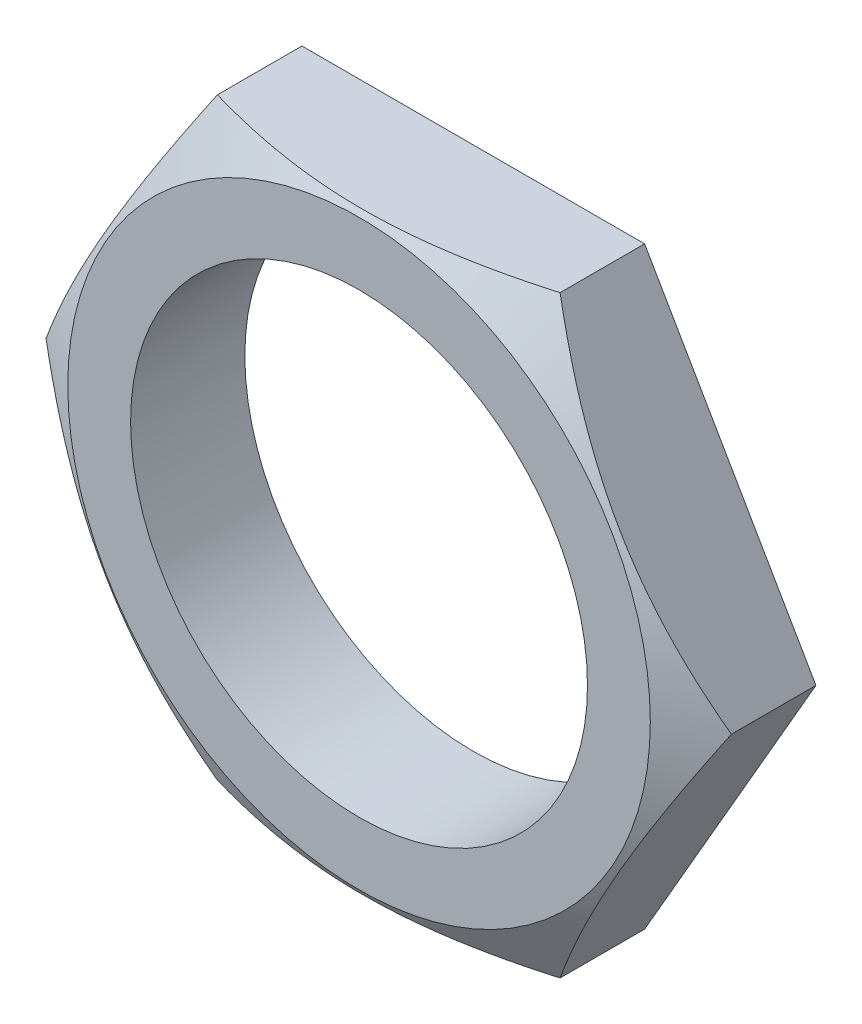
ISO-10303-21;
HEADER;
FILE_DESCRIPTION(('STEP AP214'),'2;1');
FILE_NAME('part.step','',(''),(''),'','','');
FILE_SCHEMA(('AUTOMOTIVE_DESIGN { 1 0 10303 214 1 1 1 1 }'));
ENDSEC;
DATA;
#1=APPLICATION_CONTEXT('core data for automotive mechanical design processes');
#2=APPLICATION_PROTOCOL_DEFINITION('international standard','automotive_design',2000,#1);
#3=PRODUCT_CONTEXT('',#1,'mechanical');
#4=PRODUCT('Part','Part','',(#3));
#5=PRODUCT_RELATED_PRODUCT_CATEGORY('part','',(#4));
#6=PRODUCT_DEFINITION_FORMATION('','',#4);
#7=PRODUCT_DEFINITION_CONTEXT('part definition',#1,'design');
#8=PRODUCT_DEFINITION('design','',#6,#7);
#9=PRODUCT_DEFINITION_SHAPE('','',#8);
#10=(LENGTH_UNIT() NAMED_UNIT(*) SI_UNIT(.MILLI.,.METRE.));
#11=(NAMED_UNIT(*) PLANE_ANGLE_UNIT() SI_UNIT($,.RADIAN.));
#12=(NAMED_UNIT(*) SI_UNIT($,.STERADIAN.) SOLID_ANGLE_UNIT());
#13=UNCERTAINTY_MEASURE_WITH_UNIT(LENGTH_MEASURE(1.E-05),#10,'distance_accuracy_value','');
#14=(GEOMETRIC_REPRESENTATION_CONTEXT(3) GLOBAL_UNCERTAINTY_ASSIGNED_CONTEXT((#13)) GLOBAL_UNIT_ASSIGNED_CONTEXT((#10,
#11,#12)) REPRESENTATION_CONTEXT('',''));
#15=CARTESIAN_POINT('',(0.,0.,0.));
#16=DIRECTION('',(0.,0.,1.));
#17=DIRECTION('',(1.,0.,0.));
#18=AXIS2_PLACEMENT_3D('',#15,#16,#17);
#19=CARTESIAN_POINT('',(0.,0.,2.));
#20=DIRECTION('',(0.,0.,1.));
#21=DIRECTION('',(1.,0.,0.));
#22=AXIS2_PLACEMENT_3D('',#19,#20,#21);
#23=PLANE('',#22);
#24=CARTESIAN_POINT('',(0.,0.,2.));
#25=DIRECTION('',(0.,0.,1.));
#26=DIRECTION('',(1.,0.,0.));
#27=AXIS2_PLACEMENT_3D('',#24,#25,#26);
#28=CIRCLE('',#27,5.1);
#29=CARTESIAN_POINT('',(5.1,0.,2.));
#30=VERTEX_POINT('',#29);
#31=EDGE_CURVE('E44',#30,#30,#28,.T.);
#32=ORIENTED_EDGE('',*,*,#31,.T.);
#33=EDGE_LOOP('',(#32));
#34=FACE_BOUND('',#33,.T.);
#35=CARTESIAN_POINT('',(0.,0.,2.));
#36=DIRECTION('',(0.,0.,1.));
#37=DIRECTION('',(1.,0.,0.));
#38=AXIS2_PLACEMENT_3D('',#35,#36,#37);
#39=CIRCLE('',#38,4.);
#40=CARTESIAN_POINT('',(4.,0.,2.));
#41=VERTEX_POINT('',#40);
#42=EDGE_CURVE('E123',#41,#41,#39,.T.);
#43=ORIENTED_EDGE('',*,*,#42,.F.);
#44=EDGE_LOOP('',(#43));
#45=FACE_BOUND('',#44,.T.);
#46=ADVANCED_FACE('F32',(#34,#45),#23,.T.);
#47=CARTESIAN_POINT('',(0.,0.,0.));
#48=DIRECTION('',(0.,0.,1.));
#49=DIRECTION('',(1.,0.,0.));
#50=AXIS2_PLACEMENT_3D('',#47,#48,#49);
#51=PLANE('',#50);
#52=DIRECTION('',(1.,0.,0.));
#53=VECTOR('',#52,1.);
#54=CARTESIAN_POINT('',(2.99999999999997,-5.19615242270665,0.));
#55=LINE('',#54,#53);
#56=CARTESIAN_POINT('',(-3.00000000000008,-5.19615242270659,0.));
#57=VERTEX_POINT('',#56);
#58=CARTESIAN_POINT('',(2.99999999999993,-5.19615242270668,0.));
#59=VERTEX_POINT('',#58);
#60=EDGE_CURVE('E107',#57,#59,#55,.T.);
#61=ORIENTED_EDGE('',*,*,#60,.F.);
#62=DIRECTION('',(0.499999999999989,-0.866025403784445,0.));
#63=VECTOR('',#62,1.);
#64=CARTESIAN_POINT('',(-3.00000000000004,-5.19615242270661,0.));
#65=LINE('',#64,#63);
#66=CARTESIAN_POINT('',(-6.,1.04517089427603E-13,0.));
#67=VERTEX_POINT('',#66);
#68=EDGE_CURVE('E91',#67,#57,#65,.T.);
#69=ORIENTED_EDGE('',*,*,#68,.F.);
#70=DIRECTION('',(-0.500000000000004,-0.866025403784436,0.));
#71=VECTOR('',#70,1.);
#72=CARTESIAN_POINT('',(-6.,0.,0.));
#73=LINE('',#72,#71);
#74=CARTESIAN_POINT('',(-2.99999999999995,5.19615242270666,0.));
#75=VERTEX_POINT('',#74);
#76=EDGE_CURVE('E105',#75,#67,#73,.T.);
#77=ORIENTED_EDGE('',*,*,#76,.F.);
#78=DIRECTION('',(-1.,0.,0.));
#79=VECTOR('',#78,1.);
#80=CARTESIAN_POINT('',(-2.99999999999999,5.19615242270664,0.));
#81=LINE('',#80,#79);
#82=CARTESIAN_POINT('',(3.00000000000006,5.1961524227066,0.));
#83=VERTEX_POINT('',#82);
#84=EDGE_CURVE('E51',#83,#75,#81,.T.);
#85=ORIENTED_EDGE('',*,*,#84,.F.);
#86=DIRECTION('',(-0.499999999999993,0.866025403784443,0.));
#87=VECTOR('',#86,1.);
#88=CARTESIAN_POINT('',(3.00000000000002,5.19615242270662,0.));
#89=LINE('',#88,#87);
#90=CARTESIAN_POINT('',(6.,0.,0.));
#91=VERTEX_POINT('',#90);
#92=EDGE_CURVE('E236',#91,#83,#89,.T.);
#93=ORIENTED_EDGE('',*,*,#92,.F.);
#94=DIRECTION('',(0.500000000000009,0.866025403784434,0.));
#95=VECTOR('',#94,1.);
#96=CARTESIAN_POINT('',(6.,0.,0.));
#97=LINE('',#96,#95);
#98=EDGE_CURVE('E216',#59,#91,#97,.T.);
#99=ORIENTED_EDGE('',*,*,#98,.F.);
#100=EDGE_LOOP('',(#61,#69,#77,#85,#93,#99));
#101=FACE_BOUND('',#100,.T.);
#102=CARTESIAN_POINT('',(0.,0.,0.));
#103=DIRECTION('',(0.,0.,1.));
#104=DIRECTION('',(1.,0.,0.));
#105=AXIS2_PLACEMENT_3D('',#102,#103,#104);
#106=CIRCLE('',#105,4.);
#107=CARTESIAN_POINT('',(4.,0.,0.));
#108=VERTEX_POINT('',#107);
#109=EDGE_CURVE('E98',#108,#108,#106,.T.);
#110=ORIENTED_EDGE('',*,*,#109,.T.);
#111=EDGE_LOOP('',(#110));
#112=FACE_BOUND('',#111,.T.);
#113=ADVANCED_FACE('F103',(#101,#112),#51,.F.);
#114=CARTESIAN_POINT('',(0.,0.,2.));
#115=DIRECTION('',(0.,0.,-1.));
#116=DIRECTION('',(-1.,0.,0.));
#117=AXIS2_PLACEMENT_3D('',#114,#115,#116);
#118=CYLINDRICAL_SURFACE('',#117,4.);
#119=ORIENTED_EDGE('',*,*,#42,.T.);
#120=EDGE_LOOP('',(#119));
#121=FACE_BOUND('',#120,.T.);
#122=ORIENTED_EDGE('',*,*,#109,.F.);
#123=EDGE_LOOP('',(#122));
#124=FACE_BOUND('',#123,.T.);
#125=ADVANCED_FACE('F132',(#121,#124),#118,.F.);
#126=CARTESIAN_POINT('',(0.,0.,2.));
#127=DIRECTION('',(0.,0.,-1.));
#128=DIRECTION('',(-1.,0.,0.));
#129=AXIS2_PLACEMENT_3D('',#126,#127,#128);
#130=CONICAL_SURFACE('',#129,5.1,1.0471975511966);
#131=CARTESIAN_POINT('',(-2.9998845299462,-5.19635242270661,1.48031808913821));
#132=CARTESIAN_POINT('',(-3.13169826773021,-4.96804433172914,1.55646505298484));
#133=CARTESIAN_POINT('',(-3.26468003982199,-4.73771314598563,1.62570871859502));
#134=CARTESIAN_POINT('',(-3.53294613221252,-4.27306264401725,1.74657255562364));
#135=CARTESIAN_POINT('',(-3.66823521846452,-4.03873507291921,1.79814996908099));
#136=CARTESIAN_POINT('',(-3.87072592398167,-3.68801088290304,1.85863465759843));
#137=CARTESIAN_POINT('',(-3.93730567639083,-3.57269136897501,1.87586582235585));
#138=CARTESIAN_POINT('',(-4.07076321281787,-3.34153613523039,1.90475992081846));
#139=CARTESIAN_POINT('',(-4.13764096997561,-3.22570046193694,1.91642334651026));
#140=CARTESIAN_POINT('',(-4.27151340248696,-2.99382660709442,1.93388524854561));
#141=CARTESIAN_POINT('',(-4.33850785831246,-2.87778880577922,1.9396903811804));
#142=CARTESIAN_POINT('',(-4.47255477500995,-2.64561273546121,1.94531730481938));
#143=CARTESIAN_POINT('',(-4.53960723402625,-2.52947446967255,1.94513928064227));
#144=CARTESIAN_POINT('',(-4.7233127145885,-2.21128724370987,1.93642719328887));
#145=CARTESIAN_POINT('',(-4.8399056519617,-2.00934235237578,1.92179956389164));
#146=CARTESIAN_POINT('',(-5.072317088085,-1.60679393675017,1.87541369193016));
#147=CARTESIAN_POINT('',(-5.18813476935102,-1.40619182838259,1.84363959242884));
#148=CARTESIAN_POINT('',(-5.42101397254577,-1.00283321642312,1.76421296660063));
#149=CARTESIAN_POINT('',(-5.53804610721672,-0.800127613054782,1.71622389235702));
#150=CARTESIAN_POINT('',(-5.77036502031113,-0.397739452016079,1.60730782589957));
#151=CARTESIAN_POINT('',(-5.88565477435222,-0.198051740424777,1.54640642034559));
#152=CARTESIAN_POINT('',(-6.00011547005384,0.000200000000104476,1.48031808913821));
#153=B_SPLINE_CURVE_WITH_KNOTS('',3,(#131,#132,#133,#134,#135,#136,#137,#138,#139,#140,#141,
#142,#143,#144,#145,#146,#147,#148,#149,#150,#151,#152),.UNSPECIFIED.,.F.,.F.,(4,2,2,2,2,2,2,2,
2,2,4),(0.,0.82364757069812,1.64927477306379,2.05197669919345,2.45464303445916,2.85685133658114,
3.2590472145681,3.95924494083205,4.66009131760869,5.37648226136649,6.09146667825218),.UNSPECIFIED.);
#154=CARTESIAN_POINT('',(-3.00000000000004,-5.19615242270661,1.48038475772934));
#155=VERTEX_POINT('',#154);
#156=CARTESIAN_POINT('',(-6.,1.04517089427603E-13,1.48038475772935));
#157=VERTEX_POINT('',#156);
#158=EDGE_CURVE('E94',#155,#157,#153,.T.);
#159=ORIENTED_EDGE('',*,*,#158,.F.);
#160=CARTESIAN_POINT('',(-7.9487448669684,-5.19615242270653,-0.538291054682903));
#161=CARTESIAN_POINT('',(-7.72066422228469,-5.19615242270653,-0.428101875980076));
#162=CARTESIAN_POINT('',(-7.49204344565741,-5.19615242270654,-0.319010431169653));
#163=CARTESIAN_POINT('',(-7.03342954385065,-5.19615242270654,-0.103650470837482));
#164=CARTESIAN_POINT('',(-6.80343618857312,-5.19615242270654,0.00261755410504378));
#165=CARTESIAN_POINT('',(-6.34053883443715,-5.19615242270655,0.212264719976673));
#166=CARTESIAN_POINT('',(-6.1076257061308,-5.19615242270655,0.315623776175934));
#167=CARTESIAN_POINT('',(-5.63988224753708,-5.19615242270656,0.517891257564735));
#168=CARTESIAN_POINT('',(-5.4050520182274,-5.19615242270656,0.61679991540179));
#169=CARTESIAN_POINT('',(-4.93022155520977,-5.19615242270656,0.810142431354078));
#170=CARTESIAN_POINT('',(-4.69019315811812,-5.19615242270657,0.904507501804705));
#171=CARTESIAN_POINT('',(-4.20730228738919,-5.19615242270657,1.08582769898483));
#172=CARTESIAN_POINT('',(-3.96443950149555,-5.19615242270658,1.17278200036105));
#173=CARTESIAN_POINT('',(-3.47599572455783,-5.19615242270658,1.33693883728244));
#174=CARTESIAN_POINT('',(-3.23042179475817,-5.19615242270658,1.41416217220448));
#175=CARTESIAN_POINT('',(-2.73578062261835,-5.19615242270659,1.55634322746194));
#176=CARTESIAN_POINT('',(-2.48671451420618,-5.19615242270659,1.62130483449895));
#177=CARTESIAN_POINT('',(-1.98492771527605,-5.1961524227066,1.73580793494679));
#178=CARTESIAN_POINT('',(-1.73220597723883,-5.1961524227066,1.78534491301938));
#179=CARTESIAN_POINT('',(-1.22368881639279,-5.19615242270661,1.86564434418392));
#180=CARTESIAN_POINT('',(-0.967893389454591,-5.19615242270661,1.89640677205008));
#181=CARTESIAN_POINT('',(-0.583797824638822,-5.19615242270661,1.92649731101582));
#182=CARTESIAN_POINT('',(-0.456094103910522,-5.19615242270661,1.93385374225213));
#183=CARTESIAN_POINT('',(-0.200483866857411,-5.19615242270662,1.94315607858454));
#184=CARTESIAN_POINT('',(-0.0725773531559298,-5.19615242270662,1.94510205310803));
#185=CARTESIAN_POINT('',(0.183165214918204,-5.19615242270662,1.9435309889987));
#186=CARTESIAN_POINT('',(0.311001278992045,-5.19615242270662,1.94001547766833));
#187=CARTESIAN_POINT('',(0.566414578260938,-5.19615242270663,1.92761028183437));
#188=CARTESIAN_POINT('',(0.693991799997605,-5.19615242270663,1.91872032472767));
#189=CARTESIAN_POINT('',(1.00345985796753,-5.19615242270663,1.89082168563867));
#190=CARTESIAN_POINT('',(1.18511054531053,-5.19615242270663,1.86910543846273));
#191=CARTESIAN_POINT('',(1.54698936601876,-5.19615242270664,1.8159876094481));
#192=CARTESIAN_POINT('',(1.72721730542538,-5.19615242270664,1.78458472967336));
#193=CARTESIAN_POINT('',(2.08613892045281,-5.19615242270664,1.71320435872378));
#194=CARTESIAN_POINT('',(2.26483087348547,-5.19615242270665,1.67321828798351));
#195=CARTESIAN_POINT('',(2.62037981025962,-5.19615242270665,1.58589062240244));
#196=CARTESIAN_POINT('',(2.79723690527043,-5.19615242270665,1.53854947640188));
#197=CARTESIAN_POINT('',(3.15345234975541,-5.19615242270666,1.43641121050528));
#198=CARTESIAN_POINT('',(3.33276627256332,-5.19615242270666,1.38146021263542));
#199=CARTESIAN_POINT('',(3.68949860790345,-5.19615242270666,1.26614516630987));
#200=CARTESIAN_POINT('',(3.86691823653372,-5.19615242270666,1.20578485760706));
#201=CARTESIAN_POINT('',(4.2191499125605,-5.19615242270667,1.08089661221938));
#202=CARTESIAN_POINT('',(4.39397101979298,-5.19615242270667,1.01639407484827));
#203=CARTESIAN_POINT('',(4.74225826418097,-5.19615242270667,0.883613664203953));
#204=CARTESIAN_POINT('',(4.91572381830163,-5.19615242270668,0.815334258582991));
#205=CARTESIAN_POINT('',(5.08855991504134,-5.19615242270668,0.745540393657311));
#206=B_SPLINE_CURVE_WITH_KNOTS('',3,(#160,#161,#162,#163,#164,#165,#166,#167,#168,#169,#170,
#171,#172,#173,#174,#175,#176,#177,#178,#179,#180,#181,#182,#183,#184,#185,#186,#187,#188,#189,
#190,#191,#192,#193,#194,#195,#196,#197,#198,#199,#200,#201,#202,#203,#204,#205),.UNSPECIFIED.,
.F.,.F.,(4,2,2,2,2,2,2,2,2,2,2,2,2,2,2,2,2,2,2,2,2,2,4),(0.,0.759919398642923,1.51996998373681,
2.28438349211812,3.04875699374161,3.82239736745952,4.5961237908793,5.36816730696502,
6.13996568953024,6.91198979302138,7.68401493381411,8.06766385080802,8.45130784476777,
8.83484457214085,9.21840075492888,9.76692745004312,10.315527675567,10.8646788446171,
11.4137965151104,11.976327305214,12.5384721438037,13.0974495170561,13.6566553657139),.UNSPECIFIED.);
#207=CARTESIAN_POINT('',(2.99999999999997,-5.19615242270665,1.48038475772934));
#208=VERTEX_POINT('',#207);
#209=EDGE_CURVE('E207',#208,#155,#206,.F.);
#210=ORIENTED_EDGE('',*,*,#209,.F.);
#211=CARTESIAN_POINT('',(6.00011547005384,0.000199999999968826,1.48031808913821));
#212=CARTESIAN_POINT('',(5.86830173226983,-0.2281080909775,1.55646505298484));
#213=CARTESIAN_POINT('',(5.73531996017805,-0.458439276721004,1.62570871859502));
#214=CARTESIAN_POINT('',(5.4670538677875,-0.923089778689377,1.74657255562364));
#215=CARTESIAN_POINT('',(5.3317647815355,-1.15741734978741,1.79814996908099));
#216=CARTESIAN_POINT('',(5.12927407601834,-1.50814153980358,1.85863465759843));
#217=CARTESIAN_POINT('',(5.06269432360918,-1.62346105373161,1.87586582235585));
#218=CARTESIAN_POINT('',(4.92923678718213,-1.85461628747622,1.90475992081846));
#219=CARTESIAN_POINT('',(4.86235903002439,-1.97045196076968,1.91642334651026));
#220=CARTESIAN_POINT('',(4.72848659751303,-2.20232581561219,1.93388524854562));
#221=CARTESIAN_POINT('',(4.66149214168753,-2.31836361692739,1.9396903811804));
#222=CARTESIAN_POINT('',(4.52744522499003,-2.55053968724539,1.94531730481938));
#223=CARTESIAN_POINT('',(4.46039276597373,-2.66667795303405,1.94513928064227));
#224=CARTESIAN_POINT('',(4.27668728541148,-2.98486517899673,1.93642719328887));
#225=CARTESIAN_POINT('',(4.16009434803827,-3.18681007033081,1.92179956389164));
#226=CARTESIAN_POINT('',(3.92768291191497,-3.58935848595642,1.87541369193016));
#227=CARTESIAN_POINT('',(3.81186523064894,-3.789960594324,1.84363959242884));
#228=CARTESIAN_POINT('',(3.57898602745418,-4.19331920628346,1.76421296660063));
#229=CARTESIAN_POINT('',(3.46195389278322,-4.3960248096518,1.71622389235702));
#230=CARTESIAN_POINT('',(3.22963497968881,-4.7984129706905,1.60730782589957));
#231=CARTESIAN_POINT('',(3.11434522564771,-4.9981006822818,1.54640642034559));
#232=CARTESIAN_POINT('',(2.99988452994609,-5.19635242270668,1.48031808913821));
#233=B_SPLINE_CURVE_WITH_KNOTS('',3,(#211,#212,#213,#214,#215,#216,#217,#218,#219,#220,#221,
#222,#223,#224,#225,#226,#227,#228,#229,#230,#231,#232),.UNSPECIFIED.,.F.,.F.,(4,2,2,2,2,2,2,2,
2,2,4),(0.,0.82364757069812,1.64927477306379,2.05197669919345,2.45464303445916,2.85685133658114,
3.2590472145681,3.95924494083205,4.66009131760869,5.37648226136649,6.09146667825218),.UNSPECIFIED.);
#234=CARTESIAN_POINT('',(6.,0.,1.48038475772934));
#235=VERTEX_POINT('',#234);
#236=EDGE_CURVE('E218',#235,#208,#233,.T.);
#237=ORIENTED_EDGE('',*,*,#236,.F.);
#238=CARTESIAN_POINT('',(2.99988452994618,5.19635242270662,1.48031808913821));
#239=CARTESIAN_POINT('',(3.13169826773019,4.96804433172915,1.55646505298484));
#240=CARTESIAN_POINT('',(3.26468003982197,4.73771314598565,1.62570871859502));
#241=CARTESIAN_POINT('',(3.5329461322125,4.27306264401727,1.74657255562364));
#242=CARTESIAN_POINT('',(3.6682352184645,4.03873507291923,1.79814996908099));
#243=CARTESIAN_POINT('',(3.87072592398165,3.68801088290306,1.85863465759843));
#244=CARTESIAN_POINT('',(3.93730567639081,3.57269136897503,1.87586582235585));
#245=CARTESIAN_POINT('',(4.07076321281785,3.34153613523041,1.90475992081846));
#246=CARTESIAN_POINT('',(4.13764096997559,3.22570046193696,1.91642334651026));
#247=CARTESIAN_POINT('',(4.27151340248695,2.99382660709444,1.93388524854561));
#248=CARTESIAN_POINT('',(4.33850785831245,2.87778880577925,1.9396903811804));
#249=CARTESIAN_POINT('',(4.47255477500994,2.64561273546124,1.94531730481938));
#250=CARTESIAN_POINT('',(4.53960723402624,2.52947446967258,1.94513928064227));
#251=CARTESIAN_POINT('',(4.72331271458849,2.21128724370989,1.93642719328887));
#252=CARTESIAN_POINT('',(4.83990565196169,2.00934235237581,1.92179956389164));
#253=CARTESIAN_POINT('',(5.07231708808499,1.6067939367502,1.87541369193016));
#254=CARTESIAN_POINT('',(5.18813476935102,1.40619182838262,1.84363959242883));
#255=CARTESIAN_POINT('',(5.42101397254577,1.00283321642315,1.76421296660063));
#256=CARTESIAN_POINT('',(5.53804610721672,0.80012761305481,1.71622389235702));
#257=CARTESIAN_POINT('',(5.77036502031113,0.397739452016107,1.60730782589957));
#258=CARTESIAN_POINT('',(5.88565477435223,0.198051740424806,1.54640642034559));
#259=CARTESIAN_POINT('',(6.00011547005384,-0.000200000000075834,1.4803180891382));
#260=B_SPLINE_CURVE_WITH_KNOTS('',3,(#238,#239,#240,#241,#242,#243,#244,#245,#246,#247,#248,
#249,#250,#251,#252,#253,#254,#255,#256,#257,#258,#259),.UNSPECIFIED.,.F.,.F.,(4,2,2,2,2,2,2,2,
2,2,4),(0.,0.823647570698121,1.64927477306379,2.05197669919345,2.45464303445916,
2.85685133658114,3.2590472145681,3.95924494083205,4.66009131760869,5.37648226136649,
6.09146667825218),.UNSPECIFIED.);
#261=CARTESIAN_POINT('',(3.00000000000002,5.19615242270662,1.48038475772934));
#262=VERTEX_POINT('',#261);
#263=EDGE_CURVE('E230',#262,#235,#260,.T.);
#264=ORIENTED_EDGE('',*,*,#263,.F.);
#265=CARTESIAN_POINT('',(-7.94874486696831,5.19615242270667,-0.538291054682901));
#266=CARTESIAN_POINT('',(-7.72066422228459,5.19615242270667,-0.428101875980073));
#267=CARTESIAN_POINT('',(-7.49204344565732,5.19615242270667,-0.319010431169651));
#268=CARTESIAN_POINT('',(-7.03342954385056,5.19615242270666,-0.103650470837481));
#269=CARTESIAN_POINT('',(-6.80343618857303,5.19615242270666,0.00261755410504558));
#270=CARTESIAN_POINT('',(-6.34053883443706,5.19615242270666,0.212264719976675));
#271=CARTESIAN_POINT('',(-6.10762570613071,5.19615242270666,0.315623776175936));
#272=CARTESIAN_POINT('',(-5.63988224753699,5.19615242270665,0.517891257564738));
#273=CARTESIAN_POINT('',(-5.40505201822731,5.19615242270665,0.616799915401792));
#274=CARTESIAN_POINT('',(-4.93022155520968,5.19615242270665,0.81014243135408));
#275=CARTESIAN_POINT('',(-4.69019315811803,5.19615242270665,0.904507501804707));
#276=CARTESIAN_POINT('',(-4.20730228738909,5.19615242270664,1.08582769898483));
#277=CARTESIAN_POINT('',(-3.96443950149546,5.19615242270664,1.17278200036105));
#278=CARTESIAN_POINT('',(-3.47599572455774,5.19615242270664,1.33693883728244));
#279=CARTESIAN_POINT('',(-3.23042179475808,5.19615242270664,1.41416217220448));
#280=CARTESIAN_POINT('',(-2.73578062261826,5.19615242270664,1.55634322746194));
#281=CARTESIAN_POINT('',(-2.48671451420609,5.19615242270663,1.62130483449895));
#282=CARTESIAN_POINT('',(-1.98492771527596,5.19615242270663,1.73580793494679));
#283=CARTESIAN_POINT('',(-1.73220597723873,5.19615242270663,1.78534491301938));
#284=CARTESIAN_POINT('',(-1.2236888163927,5.19615242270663,1.86564434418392));
#285=CARTESIAN_POINT('',(-0.9678933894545,5.19615242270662,1.89640677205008));
#286=CARTESIAN_POINT('',(-0.583797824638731,5.19615242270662,1.92649731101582));
#287=CARTESIAN_POINT('',(-0.45609410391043,5.19615242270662,1.93385374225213));
#288=CARTESIAN_POINT('',(-0.20048386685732,5.19615242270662,1.94315607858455));
#289=CARTESIAN_POINT('',(-0.0725773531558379,5.19615242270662,1.94510205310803));
#290=CARTESIAN_POINT('',(0.183165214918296,5.19615242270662,1.94353098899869));
#291=CARTESIAN_POINT('',(0.311001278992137,5.19615242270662,1.94001547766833));
#292=CARTESIAN_POINT('',(0.566414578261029,5.19615242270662,1.92761028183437));
#293=CARTESIAN_POINT('',(0.693991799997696,5.19615242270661,1.91872032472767));
#294=CARTESIAN_POINT('',(1.00345985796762,5.19615242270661,1.89082168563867));
#295=CARTESIAN_POINT('',(1.18511054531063,5.19615242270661,1.86910543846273));
#296=CARTESIAN_POINT('',(1.54698936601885,5.19615242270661,1.8159876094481));
#297=CARTESIAN_POINT('',(1.72721730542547,5.19615242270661,1.78458472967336));
#298=CARTESIAN_POINT('',(2.0861389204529,5.19615242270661,1.71320435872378));
#299=CARTESIAN_POINT('',(2.26483087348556,5.1961524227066,1.67321828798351));
#300=CARTESIAN_POINT('',(2.62037981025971,5.1961524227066,1.58589062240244));
#301=CARTESIAN_POINT('',(2.79723690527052,5.1961524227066,1.53854947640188));
#302=CARTESIAN_POINT('',(3.1534523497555,5.1961524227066,1.43641121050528));
#303=CARTESIAN_POINT('',(3.33276627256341,5.1961524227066,1.38146021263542));
#304=CARTESIAN_POINT('',(3.68949860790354,5.1961524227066,1.26614516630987));
#305=CARTESIAN_POINT('',(3.86691823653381,5.19615242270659,1.20578485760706));
#306=CARTESIAN_POINT('',(4.21914991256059,5.19615242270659,1.08089661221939));
#307=CARTESIAN_POINT('',(4.39397101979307,5.19615242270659,1.01639407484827));
#308=CARTESIAN_POINT('',(4.74225826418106,5.19615242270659,0.883613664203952));
#309=CARTESIAN_POINT('',(4.91572381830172,5.19615242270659,0.81533425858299));
#310=CARTESIAN_POINT('',(5.08855991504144,5.19615242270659,0.74554039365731));
#311=B_SPLINE_CURVE_WITH_KNOTS('',3,(#265,#266,#267,#268,#269,#270,#271,#272,#273,#274,#275,
#276,#277,#278,#279,#280,#281,#282,#283,#284,#285,#286,#287,#288,#289,#290,#291,#292,#293,#294,
#295,#296,#297,#298,#299,#300,#301,#302,#303,#304,#305,#306,#307,#308,#309,#310),.UNSPECIFIED.,
.F.,.F.,(4,2,2,2,2,2,2,2,2,2,2,2,2,2,2,2,2,2,2,2,2,2,4),(0.,0.759919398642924,1.51996998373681,
2.28438349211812,3.04875699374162,3.82239736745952,4.5961237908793,5.36816730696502,
6.13996568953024,6.91198979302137,7.6840149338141,8.06766385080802,8.45130784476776,
8.83484457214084,9.21840075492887,9.76692745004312,10.315527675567,10.8646788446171,
11.4137965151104,11.976327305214,12.5384721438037,13.0974495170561,13.6566553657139),.UNSPECIFIED.);
#312=CARTESIAN_POINT('',(-2.99999999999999,5.19615242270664,1.48038475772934));
#313=VERTEX_POINT('',#312);
#314=EDGE_CURVE('E110',#313,#262,#311,.T.);
#315=ORIENTED_EDGE('',*,*,#314,.F.);
#316=CARTESIAN_POINT('',(-6.00011547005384,-0.000200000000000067,1.48031808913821));
#317=CARTESIAN_POINT('',(-5.86830173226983,0.228108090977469,1.55646505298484));
#318=CARTESIAN_POINT('',(-5.73531996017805,0.458439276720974,1.62570871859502));
#319=CARTESIAN_POINT('',(-5.46705386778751,0.923089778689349,1.74657255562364));
#320=CARTESIAN_POINT('',(-5.3317647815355,1.15741734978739,1.79814996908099));
#321=CARTESIAN_POINT('',(-5.12927407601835,1.50814153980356,1.85863465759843));
#322=CARTESIAN_POINT('',(-5.06269432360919,1.62346105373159,1.87586582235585));
#323=CARTESIAN_POINT('',(-4.92923678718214,1.8546162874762,1.90475992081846));
#324=CARTESIAN_POINT('',(-4.8623590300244,1.97045196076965,1.91642334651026));
#325=CARTESIAN_POINT('',(-4.72848659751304,2.20232581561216,1.93388524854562));
#326=CARTESIAN_POINT('',(-4.66149214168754,2.31836361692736,1.9396903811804));
#327=CARTESIAN_POINT('',(-4.52744522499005,2.55053968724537,1.94531730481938));
#328=CARTESIAN_POINT('',(-4.46039276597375,2.66667795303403,1.94513928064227));
#329=CARTESIAN_POINT('',(-4.27668728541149,2.98486517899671,1.93642719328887));
#330=CARTESIAN_POINT('',(-4.16009434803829,3.18681007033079,1.92179956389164));
#331=CARTESIAN_POINT('',(-3.92768291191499,3.5893584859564,1.87541369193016));
#332=CARTESIAN_POINT('',(-3.81186523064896,3.78996059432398,1.84363959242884));
#333=CARTESIAN_POINT('',(-3.5789860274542,4.19331920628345,1.76421296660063));
#334=CARTESIAN_POINT('',(-3.46195389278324,4.39602480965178,1.71622389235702));
#335=CARTESIAN_POINT('',(-3.22963497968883,4.79841297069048,1.60730782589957));
#336=CARTESIAN_POINT('',(-3.11434522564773,4.99810068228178,1.54640642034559));
#337=CARTESIAN_POINT('',(-2.99988452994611,5.19635242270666,1.48031808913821));
#338=B_SPLINE_CURVE_WITH_KNOTS('',3,(#316,#317,#318,#319,#320,#321,#322,#323,#324,#325,#326,
#327,#328,#329,#330,#331,#332,#333,#334,#335,#336,#337),.UNSPECIFIED.,.F.,.F.,(4,2,2,2,2,2,2,2,
2,2,4),(0.,0.82364757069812,1.64927477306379,2.05197669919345,2.45464303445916,2.85685133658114,
3.2590472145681,3.95924494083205,4.66009131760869,5.37648226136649,6.09146667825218),.UNSPECIFIED.);
#339=EDGE_CURVE('E11',#157,#313,#338,.T.);
#340=ORIENTED_EDGE('',*,*,#339,.F.);
#341=EDGE_LOOP('',(#159,#210,#237,#264,#315,#340));
#342=FACE_BOUND('',#341,.T.);
#343=ORIENTED_EDGE('',*,*,#31,.F.);
#344=EDGE_LOOP('',(#343));
#345=FACE_BOUND('',#344,.T.);
#346=ADVANCED_FACE('F130',(#342,#345),#130,.T.);
#347=CARTESIAN_POINT('',(-6.,0.,2.));
#348=DIRECTION('',(0.866025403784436,-0.500000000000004,0.));
#349=DIRECTION('',(0.500000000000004,0.866025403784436,0.));
#350=AXIS2_PLACEMENT_3D('',#347,#348,#349);
#351=PLANE('',#350);
#352=ORIENTED_EDGE('',*,*,#339,.T.);
#353=DIRECTION('',(0.,0.,-1.));
#354=VECTOR('',#353,1.);
#355=CARTESIAN_POINT('',(-2.99999999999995,5.19615242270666,2.));
#356=LINE('',#355,#354);
#357=EDGE_CURVE('E55',#313,#75,#356,.T.);
#358=ORIENTED_EDGE('',*,*,#357,.T.);
#359=ORIENTED_EDGE('',*,*,#76,.T.);
#360=DIRECTION('',(0.,0.,-1.));
#361=VECTOR('',#360,1.);
#362=CARTESIAN_POINT('',(-6.,0.,2.));
#363=LINE('',#362,#361);
#364=EDGE_CURVE('E88',#157,#67,#363,.T.);
#365=ORIENTED_EDGE('',*,*,#364,.F.);
#366=EDGE_LOOP('',(#352,#358,#359,#365));
#367=FACE_BOUND('',#366,.T.);
#368=ADVANCED_FACE('F109',(#367),#351,.F.);
#369=CARTESIAN_POINT('',(-2.99999999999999,5.19615242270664,2.));
#370=DIRECTION('',(0.,-1.,0.));
#371=DIRECTION('',(1.,0.,0.));
#372=AXIS2_PLACEMENT_3D('',#369,#370,#371);
#373=PLANE('',#372);
#374=ORIENTED_EDGE('',*,*,#314,.T.);
#375=DIRECTION('',(0.,0.,-1.));
#376=VECTOR('',#375,1.);
#377=CARTESIAN_POINT('',(3.00000000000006,5.1961524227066,2.));
#378=LINE('',#377,#376);
#379=EDGE_CURVE('E113',#262,#83,#378,.T.);
#380=ORIENTED_EDGE('',*,*,#379,.T.);
#381=ORIENTED_EDGE('',*,*,#84,.T.);
#382=ORIENTED_EDGE('',*,*,#357,.F.);
#383=EDGE_LOOP('',(#374,#380,#381,#382));
#384=FACE_BOUND('',#383,.T.);
#385=ADVANCED_FACE('F138',(#384),#373,.F.);
#386=CARTESIAN_POINT('',(3.00000000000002,5.19615242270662,2.));
#387=DIRECTION('',(-0.866025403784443,-0.499999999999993,0.));
#388=DIRECTION('',(0.499999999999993,-0.866025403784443,0.));
#389=AXIS2_PLACEMENT_3D('',#386,#387,#388);
#390=PLANE('',#389);
#391=ORIENTED_EDGE('',*,*,#263,.T.);
#392=DIRECTION('',(0.,0.,-1.));
#393=VECTOR('',#392,1.);
#394=CARTESIAN_POINT('',(6.,0.,2.));
#395=LINE('',#394,#393);
#396=EDGE_CURVE('E224',#235,#91,#395,.T.);
#397=ORIENTED_EDGE('',*,*,#396,.T.);
#398=ORIENTED_EDGE('',*,*,#92,.T.);
#399=ORIENTED_EDGE('',*,*,#379,.F.);
#400=EDGE_LOOP('',(#391,#397,#398,#399));
#401=FACE_BOUND('',#400,.T.);
#402=ADVANCED_FACE('F167',(#401),#390,.F.);
#403=CARTESIAN_POINT('',(6.,0.,2.));
#404=DIRECTION('',(-0.866025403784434,0.500000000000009,0.));
#405=DIRECTION('',(-0.500000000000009,-0.866025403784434,0.));
#406=AXIS2_PLACEMENT_3D('',#403,#404,#405);
#407=PLANE('',#406);
#408=ORIENTED_EDGE('',*,*,#236,.T.);
#409=DIRECTION('',(0.,0.,-1.));
#410=VECTOR('',#409,1.);
#411=CARTESIAN_POINT('',(2.99999999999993,-5.19615242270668,2.));
#412=LINE('',#411,#410);
#413=EDGE_CURVE('E213',#208,#59,#412,.T.);
#414=ORIENTED_EDGE('',*,*,#413,.T.);
#415=ORIENTED_EDGE('',*,*,#98,.T.);
#416=ORIENTED_EDGE('',*,*,#396,.F.);
#417=EDGE_LOOP('',(#408,#414,#415,#416));
#418=FACE_BOUND('',#417,.T.);
#419=ADVANCED_FACE('F173',(#418),#407,.F.);
#420=CARTESIAN_POINT('',(2.99999999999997,-5.19615242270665,2.));
#421=DIRECTION('',(0.,1.,0.));
#422=DIRECTION('',(-1.,0.,0.));
#423=AXIS2_PLACEMENT_3D('',#420,#421,#422);
#424=PLANE('',#423);
#425=ORIENTED_EDGE('',*,*,#209,.T.);
#426=DIRECTION('',(0.,0.,-1.));
#427=VECTOR('',#426,1.);
#428=CARTESIAN_POINT('',(-3.00000000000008,-5.19615242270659,2.));
#429=LINE('',#428,#427);
#430=EDGE_CURVE('E204',#155,#57,#429,.T.);
#431=ORIENTED_EDGE('',*,*,#430,.T.);
#432=ORIENTED_EDGE('',*,*,#60,.T.);
#433=ORIENTED_EDGE('',*,*,#413,.F.);
#434=EDGE_LOOP('',(#425,#431,#432,#433));
#435=FACE_BOUND('',#434,.T.);
#436=ADVANCED_FACE('F181',(#435),#424,.F.);
#437=CARTESIAN_POINT('',(-3.00000000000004,-5.19615242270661,2.));
#438=DIRECTION('',(0.866025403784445,0.499999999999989,0.));
#439=DIRECTION('',(-0.499999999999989,0.866025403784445,0.));
#440=AXIS2_PLACEMENT_3D('',#437,#438,#439);
#441=PLANE('',#440);
#442=ORIENTED_EDGE('',*,*,#158,.T.);
#443=ORIENTED_EDGE('',*,*,#364,.T.);
#444=ORIENTED_EDGE('',*,*,#68,.T.);
#445=ORIENTED_EDGE('',*,*,#430,.F.);
#446=EDGE_LOOP('',(#442,#443,#444,#445));
#447=FACE_BOUND('',#446,.T.);
#448=ADVANCED_FACE('F90',(#447),#441,.F.);
#449=CLOSED_SHELL('',(#46,#113,#125,#346,#368,#385,#402,#419,#436,#448));
#450=MANIFOLD_SOLID_BREP('B2',#449);
#451=ADVANCED_BREP_SHAPE_REPRESENTATION('',(#18,#450),#14);
#452=SHAPE_DEFINITION_REPRESENTATION(#9,#451);
ENDSEC;
END-ISO-10303-21;
